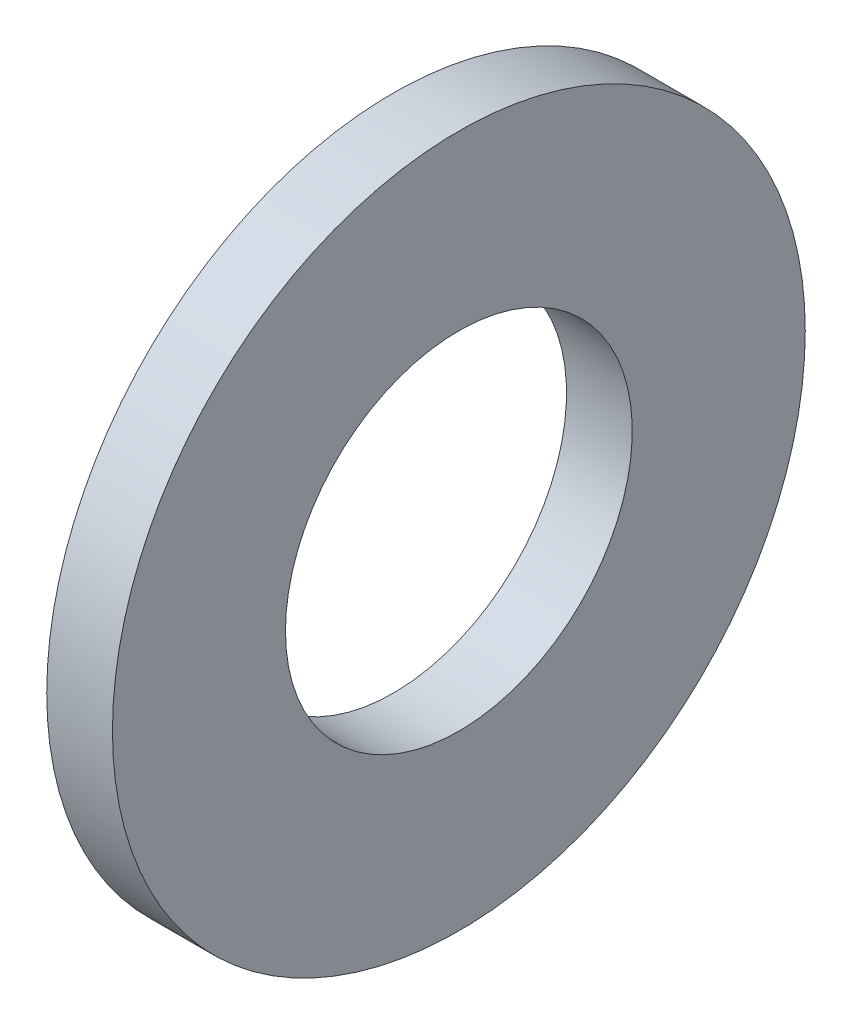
from build123d import *

# Parameters (mm, degrees)
SKETCH1_W = 2.1082
SKETCH1_H = 5.5499


with BuildPart() as part:
    # Sketch1 → Base-Revolve (revolve)
    with BuildSketch(Plane.XY, mode=Mode.PRIVATE) as base_revolve_sk:
        with Locations((-1.0541, 8.33755)):
            Rectangle(SKETCH1_W, SKETCH1_H)
    revolve(base_revolve_sk.sketch.rotate(Axis((-34.925, 0, 0), (1, 0, 0)), 90), axis=Axis((-34.925, 0, 0), (1, 0, 0)))


solid = part.part
